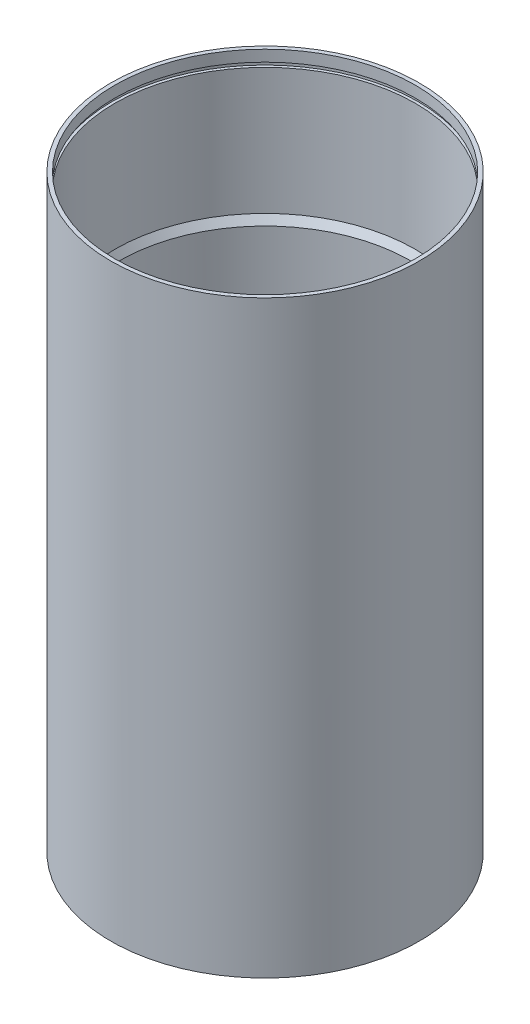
ISO-10303-21;
HEADER;
FILE_DESCRIPTION(('STEP AP214'),'2;1');
FILE_NAME('part.step','',(''),(''),'','','');
FILE_SCHEMA(('AUTOMOTIVE_DESIGN { 1 0 10303 214 1 1 1 1 }'));
ENDSEC;
DATA;
#1=APPLICATION_CONTEXT('core data for automotive mechanical design processes');
#2=APPLICATION_PROTOCOL_DEFINITION('international standard','automotive_design',2000,#1);
#3=PRODUCT_CONTEXT('',#1,'mechanical');
#4=PRODUCT('Part','Part','',(#3));
#5=PRODUCT_RELATED_PRODUCT_CATEGORY('part','',(#4));
#6=PRODUCT_DEFINITION_FORMATION('','',#4);
#7=PRODUCT_DEFINITION_CONTEXT('part definition',#1,'design');
#8=PRODUCT_DEFINITION('design','',#6,#7);
#9=PRODUCT_DEFINITION_SHAPE('','',#8);
#10=(LENGTH_UNIT() NAMED_UNIT(*) SI_UNIT(.MILLI.,.METRE.));
#11=(NAMED_UNIT(*) PLANE_ANGLE_UNIT() SI_UNIT($,.RADIAN.));
#12=(NAMED_UNIT(*) SI_UNIT($,.STERADIAN.) SOLID_ANGLE_UNIT());
#13=UNCERTAINTY_MEASURE_WITH_UNIT(LENGTH_MEASURE(1.E-05),#10,'distance_accuracy_value','');
#14=(GEOMETRIC_REPRESENTATION_CONTEXT(3) GLOBAL_UNCERTAINTY_ASSIGNED_CONTEXT((#13)) GLOBAL_UNIT_ASSIGNED_CONTEXT((#10,
#11,#12)) REPRESENTATION_CONTEXT('',''));
#15=CARTESIAN_POINT('',(0.,0.,0.));
#16=DIRECTION('',(0.,0.,1.));
#17=DIRECTION('',(1.,0.,0.));
#18=AXIS2_PLACEMENT_3D('',#15,#16,#17);
#19=CARTESIAN_POINT('',(0.,80.,0.));
#20=DIRECTION('',(0.,1.,0.));
#21=DIRECTION('',(0.,0.,1.));
#22=AXIS2_PLACEMENT_3D('',#19,#20,#21);
#23=CYLINDRICAL_SURFACE('',#22,26.8);
#24=CARTESIAN_POINT('',(0.,105.,0.));
#25=DIRECTION('',(0.,1.,0.));
#26=DIRECTION('',(0.,0.,1.));
#27=AXIS2_PLACEMENT_3D('',#24,#25,#26);
#28=CIRCLE('',#27,26.8);
#29=CARTESIAN_POINT('',(0.,105.,26.8));
#30=VERTEX_POINT('',#29);
#31=EDGE_CURVE('E264',#30,#30,#28,.T.);
#32=ORIENTED_EDGE('',*,*,#31,.T.);
#33=EDGE_LOOP('',(#32));
#34=FACE_BOUND('',#33,.T.);
#35=CARTESIAN_POINT('',(0.,103.,0.));
#36=DIRECTION('',(0.,-1.,0.));
#37=DIRECTION('',(0.,0.,-1.));
#38=AXIS2_PLACEMENT_3D('',#35,#36,#37);
#39=CIRCLE('',#38,26.8);
#40=CARTESIAN_POINT('',(0.,103.,-26.8));
#41=VERTEX_POINT('',#40);
#42=EDGE_CURVE('E296',#41,#41,#39,.T.);
#43=ORIENTED_EDGE('',*,*,#42,.T.);
#44=EDGE_LOOP('',(#43));
#45=FACE_BOUND('',#44,.T.);
#46=ADVANCED_FACE('F35',(#34,#45),#23,.F.);
#47=CARTESIAN_POINT('',(0.,79.6535898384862,0.));
#48=DIRECTION('',(0.,1.,0.));
#49=DIRECTION('',(0.,0.,1.));
#50=AXIS2_PLACEMENT_3D('',#47,#48,#49);
#51=CIRCLE('',#50,26.8);
#52=CARTESIAN_POINT('',(0.,79.6535898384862,26.8));
#53=VERTEX_POINT('',#52);
#54=EDGE_CURVE('E11',#53,#53,#51,.F.);
#55=ORIENTED_EDGE('',*,*,#54,.T.);
#56=EDGE_LOOP('',(#55));
#57=FACE_BOUND('',#56,.T.);
#58=CARTESIAN_POINT('',(0.,102.2,0.));
#59=DIRECTION('',(0.,1.,0.));
#60=DIRECTION('',(0.,0.,1.));
#61=AXIS2_PLACEMENT_3D('',#58,#59,#60);
#62=CIRCLE('',#61,26.8);
#63=CARTESIAN_POINT('',(0.,102.2,26.8));
#64=VERTEX_POINT('',#63);
#65=EDGE_CURVE('E39',#64,#64,#62,.F.);
#66=ORIENTED_EDGE('',*,*,#65,.F.);
#67=EDGE_LOOP('',(#66));
#68=FACE_BOUND('',#67,.T.);
#69=ADVANCED_FACE('F233',(#57,#68),#23,.F.);
#70=CARTESIAN_POINT('',(0.,105.,0.));
#71=DIRECTION('',(0.,-1.,0.));
#72=DIRECTION('',(0.,0.,-1.));
#73=AXIS2_PLACEMENT_3D('',#70,#71,#72);
#74=CYLINDRICAL_SURFACE('',#73,26.);
#75=CARTESIAN_POINT('',(0.,78.2679491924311,0.));
#76=DIRECTION('',(0.,1.,0.));
#77=DIRECTION('',(0.,0.,1.));
#78=AXIS2_PLACEMENT_3D('',#75,#76,#77);
#79=CIRCLE('',#78,26.);
#80=CARTESIAN_POINT('',(0.,78.2679491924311,26.));
#81=VERTEX_POINT('',#80);
#82=EDGE_CURVE('E44',#81,#81,#79,.T.);
#83=ORIENTED_EDGE('',*,*,#82,.T.);
#84=EDGE_LOOP('',(#83));
#85=FACE_BOUND('',#84,.T.);
#86=CARTESIAN_POINT('',(0.,0.,0.));
#87=DIRECTION('',(0.,1.,0.));
#88=DIRECTION('',(0.,0.,1.));
#89=AXIS2_PLACEMENT_3D('',#86,#87,#88);
#90=CIRCLE('',#89,26.);
#91=CARTESIAN_POINT('',(-8.5,0.,-24.5713247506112));
#92=VERTEX_POINT('',#91);
#93=CARTESIAN_POINT('',(8.5,0.,-24.5713247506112));
#94=VERTEX_POINT('',#93);
#95=EDGE_CURVE('E259',#92,#94,#90,.T.);
#96=ORIENTED_EDGE('',*,*,#95,.F.);
#97=CARTESIAN_POINT('',(-8.5,0.,-24.5713247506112));
#98=CARTESIAN_POINT('',(-8.44182870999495,-3.91145126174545E-05,-24.5914570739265));
#99=CARTESIAN_POINT('',(-8.38356460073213,0.00507484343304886,-24.6113723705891));
#100=CARTESIAN_POINT('',(-8.26844314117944,0.0254324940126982,-24.6502824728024));
#101=CARTESIAN_POINT('',(-8.21158749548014,0.0406878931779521,-24.6692761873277));
#102=CARTESIAN_POINT('',(-8.10094424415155,0.0811780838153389,-24.7058319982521));
#103=CARTESIAN_POINT('',(-8.04716080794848,0.106426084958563,-24.7233921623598));
#104=CARTESIAN_POINT('',(-7.94451263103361,0.166357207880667,-24.7565672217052));
#105=CARTESIAN_POINT('',(-7.89564399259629,0.20103277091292,-24.772183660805));
#106=CARTESIAN_POINT('',(-7.8059967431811,0.277695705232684,-24.8005757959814));
#107=CARTESIAN_POINT('',(-7.76500488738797,0.319405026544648,-24.8134280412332));
#108=CARTESIAN_POINT('',(-7.69063870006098,0.409782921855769,-24.8365778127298));
#109=CARTESIAN_POINT('',(-7.65726506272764,0.458452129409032,-24.8468751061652));
#110=CARTESIAN_POINT('',(-7.60082495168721,0.558818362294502,-24.8641970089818));
#111=CARTESIAN_POINT('',(-7.57734071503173,0.610258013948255,-24.8713549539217));
#112=CARTESIAN_POINT('',(-7.53933933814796,0.716610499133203,-24.8829009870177));
#113=CARTESIAN_POINT('',(-7.52481093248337,0.77151887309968,-24.8872925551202));
#114=CARTESIAN_POINT('',(-7.51002940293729,0.855780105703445,-24.8917553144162));
#115=CARTESIAN_POINT('',(-7.50626972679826,0.884505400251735,-24.892889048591));
#116=CARTESIAN_POINT('',(-7.5012566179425,0.942148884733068,-24.8944000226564));
#117=CARTESIAN_POINT('',(-7.49999932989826,0.971066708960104,-24.8947784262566));
#118=CARTESIAN_POINT('',(-7.5,1.,-24.8947785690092));
#119=B_SPLINE_CURVE_WITH_KNOTS('',3,(#97,#98,#99,#100,#101,#102,#103,#104,#105,#106,#107,#108,
#109,#110,#111,#112,#113,#114,#115,#116,#117,#118),.UNSPECIFIED.,.F.,.F.,(4,2,2,2,2,2,2,2,2,2,
4),(0.,0.18448524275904,0.369183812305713,0.554127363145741,0.738923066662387,0.917639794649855,
1.09637280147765,1.2665288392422,1.43647040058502,1.52334396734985,1.61008358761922),.UNSPECIFIED.);
#120=CARTESIAN_POINT('',(-7.50000000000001,1.,-24.8947785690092));
#121=VERTEX_POINT('',#120);
#122=EDGE_CURVE('E163',#92,#121,#119,.T.);
#123=ORIENTED_EDGE('',*,*,#122,.T.);
#124=DIRECTION('',(0.,-1.,0.));
#125=VECTOR('',#124,1.);
#126=CARTESIAN_POINT('',(-7.50000000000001,105.,-24.8947785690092));
#127=LINE('',#126,#125);
#128=CARTESIAN_POINT('',(-7.50000000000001,13.5,-24.8947785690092));
#129=VERTEX_POINT('',#128);
#130=EDGE_CURVE('E128',#129,#121,#127,.T.);
#131=ORIENTED_EDGE('',*,*,#130,.F.);
#132=CARTESIAN_POINT('',(-7.5,13.5,-24.8947785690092));
#133=CARTESIAN_POINT('',(-7.50000043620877,13.5273039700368,-24.8947781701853));
#134=CARTESIAN_POINT('',(-7.49888099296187,13.5545945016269,-24.8951157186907));
#135=CARTESIAN_POINT('',(-7.49441922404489,13.6089727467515,-24.8964593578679));
#136=CARTESIAN_POINT('',(-7.4910772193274,13.6360604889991,-24.8974653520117));
#137=CARTESIAN_POINT('',(-7.47776791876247,13.7166117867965,-24.9014673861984));
#138=CARTESIAN_POINT('',(-7.46451710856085,13.7695234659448,-24.9054475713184));
#139=CARTESIAN_POINT('',(-7.42971758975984,13.8722513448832,-24.9158508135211));
#140=CARTESIAN_POINT('',(-7.4081687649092,13.9220675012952,-24.9222739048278));
#141=CARTESIAN_POINT('',(-7.35748435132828,14.0173307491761,-24.9372837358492));
#142=CARTESIAN_POINT('',(-7.32834728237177,14.0627769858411,-24.945870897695));
#143=CARTESIAN_POINT('',(-7.26274946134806,14.1490036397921,-24.9650487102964));
#144=CARTESIAN_POINT('',(-7.22615652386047,14.189675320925,-24.9756752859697));
#145=CARTESIAN_POINT('',(-7.14709284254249,14.2643488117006,-24.998415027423));
#146=CARTESIAN_POINT('',(-7.10462047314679,14.298348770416,-25.010528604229));
#147=CARTESIAN_POINT('',(-7.01319243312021,14.3601140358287,-25.0363230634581));
#148=CARTESIAN_POINT('',(-6.96404710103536,14.3875804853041,-25.0500469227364));
#149=CARTESIAN_POINT('',(-6.86202344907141,14.4338495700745,-25.0781863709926));
#150=CARTESIAN_POINT('',(-6.80914575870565,14.4526536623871,-25.0926018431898));
#151=CARTESIAN_POINT('',(-6.71351197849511,14.4778884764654,-25.1183321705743));
#152=CARTESIAN_POINT('',(-6.67122045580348,14.4861691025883,-25.12959875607));
#153=CARTESIAN_POINT('',(-6.5859671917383,14.4972255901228,-25.1520775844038));
#154=CARTESIAN_POINT('',(-6.5430063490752,14.5000082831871,-25.1632898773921));
#155=CARTESIAN_POINT('',(-6.5,14.5,-25.1743917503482));
#156=B_SPLINE_CURVE_WITH_KNOTS('',3,(#132,#133,#134,#135,#136,#137,#138,#139,#140,#141,#142,
#143,#144,#145,#146,#147,#148,#149,#150,#151,#152,#153,#154,#155),.UNSPECIFIED.,.F.,.F.,(4,2,2,
2,2,2,2,2,2,2,2,4),(0.,0.0818603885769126,0.163708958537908,0.326932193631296,0.490157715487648,
0.653415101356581,0.819867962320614,0.986366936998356,1.1594340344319,1.33247201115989,
1.4657685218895,1.5988992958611),.UNSPECIFIED.);
#157=CARTESIAN_POINT('',(-6.5,14.5,-25.1743917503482));
#158=VERTEX_POINT('',#157);
#159=EDGE_CURVE('E206',#129,#158,#156,.T.);
#160=ORIENTED_EDGE('',*,*,#159,.T.);
#161=CARTESIAN_POINT('',(0.,14.5,0.));
#162=DIRECTION('',(0.,1.,0.));
#163=DIRECTION('',(0.,0.,1.));
#164=AXIS2_PLACEMENT_3D('',#161,#162,#163);
#165=CIRCLE('',#164,26.);
#166=CARTESIAN_POINT('',(6.5,14.5,-25.1743917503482));
#167=VERTEX_POINT('',#166);
#168=EDGE_CURVE('E126',#167,#158,#165,.T.);
#169=ORIENTED_EDGE('',*,*,#168,.F.);
#170=CARTESIAN_POINT('',(6.5,14.5,-25.1743917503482));
#171=CARTESIAN_POINT('',(6.55798855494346,14.5000388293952,-25.1594273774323));
#172=CARTESIAN_POINT('',(6.61590978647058,14.4949584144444,-25.1442504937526));
#173=CARTESIAN_POINT('',(6.73002523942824,14.4748966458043,-25.1139430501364));
#174=CARTESIAN_POINT('',(6.78621947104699,14.4599153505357,-25.0988124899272));
#175=CARTESIAN_POINT('',(6.89532098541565,14.4203778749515,-25.0690602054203));
#176=CARTESIAN_POINT('',(6.94822633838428,14.3958161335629,-25.0544387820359));
#177=CARTESIAN_POINT('',(7.04916086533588,14.3377405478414,-25.0262276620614));
#178=CARTESIAN_POINT('',(7.09719164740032,14.3042296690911,-25.0126376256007));
#179=CARTESIAN_POINT('',(7.18640708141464,14.2295156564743,-24.9871504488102));
#180=CARTESIAN_POINT('',(7.22766256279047,14.1884031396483,-24.9752360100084));
#181=CARTESIAN_POINT('',(7.30263085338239,14.0993088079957,-24.9534188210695));
#182=CARTESIAN_POINT('',(7.33634314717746,14.0513265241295,-24.9435162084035));
#183=CARTESIAN_POINT('',(7.39399061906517,13.9516435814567,-24.9264874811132));
#184=CARTESIAN_POINT('',(7.41822497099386,13.9001301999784,-24.9192768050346));
#185=CARTESIAN_POINT('',(7.45764413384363,13.7934944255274,-24.9075083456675));
#186=CARTESIAN_POINT('',(7.47283985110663,13.7383764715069,-24.9029473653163));
#187=CARTESIAN_POINT('',(7.48880964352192,13.6522935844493,-24.8981477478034));
#188=CARTESIAN_POINT('',(7.49300368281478,13.6219799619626,-24.8968855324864));
#189=CARTESIAN_POINT('',(7.49859763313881,13.5611161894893,-24.8952010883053));
#190=CARTESIAN_POINT('',(7.50000148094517,13.5305664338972,-24.8947776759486));
#191=CARTESIAN_POINT('',(7.5,13.5,-24.8947785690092));
#192=B_SPLINE_CURVE_WITH_KNOTS('',3,(#170,#171,#172,#173,#174,#175,#176,#177,#178,#179,#180,
#181,#182,#183,#184,#185,#186,#187,#188,#189,#190,#191),.UNSPECIFIED.,.F.,.F.,(4,2,2,2,2,2,2,2,
2,2,4),(0.,0.179434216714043,0.358867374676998,0.538404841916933,0.717882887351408,
0.895345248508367,1.07281973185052,1.24412390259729,1.41522095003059,1.50698200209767,
1.59861349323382),.UNSPECIFIED.);
#193=CARTESIAN_POINT('',(7.5,13.5,-24.8947785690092));
#194=VERTEX_POINT('',#193);
#195=EDGE_CURVE('E125',#167,#194,#192,.T.);
#196=ORIENTED_EDGE('',*,*,#195,.T.);
#197=DIRECTION('',(0.,-1.,0.));
#198=VECTOR('',#197,1.);
#199=CARTESIAN_POINT('',(7.5,105.,-24.8947785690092));
#200=LINE('',#199,#198);
#201=CARTESIAN_POINT('',(7.5,1.,-24.8947785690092));
#202=VERTEX_POINT('',#201);
#203=EDGE_CURVE('E119',#202,#194,#200,.F.);
#204=ORIENTED_EDGE('',*,*,#203,.F.);
#205=CARTESIAN_POINT('',(7.5,1.,-24.8947785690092));
#206=CARTESIAN_POINT('',(7.49999958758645,0.972765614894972,-24.8947784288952));
#207=CARTESIAN_POINT('',(7.50111331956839,0.9455445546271,-24.8944431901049));
#208=CARTESIAN_POINT('',(7.5055524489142,0.891303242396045,-24.8931052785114));
#209=CARTESIAN_POINT('',(7.50887757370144,0.864282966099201,-24.8921026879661));
#210=CARTESIAN_POINT('',(7.52212148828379,0.783920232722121,-24.8881051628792));
#211=CARTESIAN_POINT('',(7.53530902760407,0.731126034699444,-24.8841204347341));
#212=CARTESIAN_POINT('',(7.56994223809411,0.628618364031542,-24.8736064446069));
#213=CARTESIAN_POINT('',(7.59138885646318,0.57890524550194,-24.8670768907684));
#214=CARTESIAN_POINT('',(7.64181071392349,0.483856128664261,-24.8516281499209));
#215=CARTESIAN_POINT('',(7.6707868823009,0.438520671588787,-24.8427086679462));
#216=CARTESIAN_POINT('',(7.73586050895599,0.352666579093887,-24.8225227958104));
#217=CARTESIAN_POINT('',(7.77206740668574,0.31223958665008,-24.8112201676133));
#218=CARTESIAN_POINT('',(7.85015893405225,0.238022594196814,-24.7866229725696));
#219=CARTESIAN_POINT('',(7.89204472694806,0.204233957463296,-24.7733279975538));
#220=CARTESIAN_POINT('',(7.98206895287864,0.142773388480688,-24.7444720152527));
#221=CARTESIAN_POINT('',(8.0303921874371,0.115405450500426,-24.7288409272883));
#222=CARTESIAN_POINT('',(8.13048309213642,0.0691415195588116,-24.6961133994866));
#223=CARTESIAN_POINT('',(8.18225141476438,0.0502471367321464,-24.6790166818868));
#224=CARTESIAN_POINT('',(8.27834720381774,0.0238395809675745,-24.6469277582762));
#225=CARTESIAN_POINT('',(8.32234602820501,0.0148937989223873,-24.6321073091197));
#226=CARTESIAN_POINT('',(8.41091016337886,0.00297408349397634,-24.6020082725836));
#227=CARTESIAN_POINT('',(8.45547442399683,-9.6429937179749E-06,-24.5867304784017));
#228=CARTESIAN_POINT('',(8.5,0.,-24.5713247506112));
#229=B_SPLINE_CURVE_WITH_KNOTS('',3,(#205,#206,#207,#208,#209,#210,#211,#212,#213,#214,#215,
#216,#217,#218,#219,#220,#221,#222,#223,#224,#225,#226,#227,#228),.UNSPECIFIED.,.F.,.F.,(4,2,2,
2,2,2,2,2,2,2,2,4),(0.,0.0816520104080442,0.163293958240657,0.326134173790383,0.488993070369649,
0.65187207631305,0.817434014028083,0.983029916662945,1.15534826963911,1.32769935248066,
1.46917092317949,1.61040992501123),.UNSPECIFIED.);
#230=EDGE_CURVE('E104',#202,#94,#229,.T.);
#231=ORIENTED_EDGE('',*,*,#230,.T.);
#232=EDGE_LOOP('',(#96,#123,#131,#160,#169,#196,#204,#231));
#233=FACE_BOUND('',#232,.T.);
#234=ADVANCED_FACE('F123',(#85,#233),#74,.F.);
#235=CARTESIAN_POINT('',(0.,105.,0.));
#236=DIRECTION('',(0.,1.,0.));
#237=DIRECTION('',(0.,0.,1.));
#238=AXIS2_PLACEMENT_3D('',#235,#236,#237);
#239=PLANE('',#238);
#240=ORIENTED_EDGE('',*,*,#31,.F.);
#241=EDGE_LOOP('',(#240));
#242=FACE_BOUND('',#241,.T.);
#243=CARTESIAN_POINT('',(0.,105.,0.));
#244=DIRECTION('',(0.,1.,0.));
#245=DIRECTION('',(0.,0.,1.));
#246=AXIS2_PLACEMENT_3D('',#243,#244,#245);
#247=CIRCLE('',#246,27.5);
#248=CARTESIAN_POINT('',(0.,105.,27.5));
#249=VERTEX_POINT('',#248);
#250=EDGE_CURVE('E270',#249,#249,#247,.T.);
#251=ORIENTED_EDGE('',*,*,#250,.T.);
#252=EDGE_LOOP('',(#251));
#253=FACE_BOUND('',#252,.T.);
#254=ADVANCED_FACE('F284',(#242,#253),#239,.T.);
#255=CARTESIAN_POINT('',(0.,0.,0.));
#256=DIRECTION('',(0.,1.,0.));
#257=DIRECTION('',(0.,0.,1.));
#258=AXIS2_PLACEMENT_3D('',#255,#256,#257);
#259=PLANE('',#258);
#260=CARTESIAN_POINT('',(0.,0.,0.));
#261=DIRECTION('',(0.,1.,0.));
#262=DIRECTION('',(0.,0.,1.));
#263=AXIS2_PLACEMENT_3D('',#260,#261,#262);
#264=CIRCLE('',#263,27.5);
#265=CARTESIAN_POINT('',(-8.5,0.,-26.153393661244));
#266=VERTEX_POINT('',#265);
#267=CARTESIAN_POINT('',(8.5,0.,-26.153393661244));
#268=VERTEX_POINT('',#267);
#269=EDGE_CURVE('E269',#266,#268,#264,.T.);
#270=ORIENTED_EDGE('',*,*,#269,.F.);
#271=DIRECTION('',(0.,0.,1.));
#272=VECTOR('',#271,1.);
#273=CARTESIAN_POINT('',(-8.5,0.,0.));
#274=LINE('',#273,#272);
#275=EDGE_CURVE('E160',#266,#92,#274,.T.);
#276=ORIENTED_EDGE('',*,*,#275,.T.);
#277=ORIENTED_EDGE('',*,*,#95,.T.);
#278=DIRECTION('',(0.,0.,1.));
#279=VECTOR('',#278,1.);
#280=CARTESIAN_POINT('',(8.5,0.,0.));
#281=LINE('',#280,#279);
#282=EDGE_CURVE('E110',#94,#268,#281,.F.);
#283=ORIENTED_EDGE('',*,*,#282,.T.);
#284=EDGE_LOOP('',(#270,#276,#277,#283));
#285=FACE_BOUND('',#284,.T.);
#286=ADVANCED_FACE('F254',(#285),#259,.F.);
#287=CARTESIAN_POINT('',(0.,105.,0.));
#288=DIRECTION('',(0.,-1.,0.));
#289=DIRECTION('',(0.,0.,-1.));
#290=AXIS2_PLACEMENT_3D('',#287,#288,#289);
#291=CYLINDRICAL_SURFACE('',#290,27.5);
#292=ORIENTED_EDGE('',*,*,#250,.F.);
#293=EDGE_LOOP('',(#292));
#294=FACE_BOUND('',#293,.T.);
#295=DIRECTION('',(0.,-1.,0.));
#296=VECTOR('',#295,1.);
#297=CARTESIAN_POINT('',(-7.50000000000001,105.,-26.4575131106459));
#298=LINE('',#297,#296);
#299=CARTESIAN_POINT('',(-7.50000000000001,13.5,-26.4575131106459));
#300=VERTEX_POINT('',#299);
#301=CARTESIAN_POINT('',(-7.50000000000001,1.,-26.4575131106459));
#302=VERTEX_POINT('',#301);
#303=EDGE_CURVE('E262',#300,#302,#298,.T.);
#304=ORIENTED_EDGE('',*,*,#303,.T.);
#305=CARTESIAN_POINT('',(-7.5,1.,-26.4575131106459));
#306=CARTESIAN_POINT('',(-7.49999964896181,0.972668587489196,-26.4575129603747));
#307=CARTESIAN_POINT('',(-7.5011212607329,0.945350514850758,-26.4571952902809));
#308=CARTESIAN_POINT('',(-7.50559223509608,0.890915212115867,-26.4559273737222));
#309=CARTESIAN_POINT('',(-7.50894134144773,0.863797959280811,-26.4549772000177));
#310=CARTESIAN_POINT('',(-7.52228282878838,0.783139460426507,-26.4511880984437));
#311=CARTESIAN_POINT('',(-7.53556957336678,0.730147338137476,-26.4474105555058));
#312=CARTESIAN_POINT('',(-7.5704761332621,0.627250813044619,-26.4374396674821));
#313=CARTESIAN_POINT('',(-7.5920972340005,0.577346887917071,-26.4312459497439));
#314=CARTESIAN_POINT('',(-7.64294965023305,0.481940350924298,-26.4165860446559));
#315=CARTESIAN_POINT('',(-7.67218165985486,0.436438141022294,-26.4081196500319));
#316=CARTESIAN_POINT('',(-7.73780200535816,0.350364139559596,-26.3889674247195));
#317=CARTESIAN_POINT('',(-7.77428964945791,0.309875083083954,-26.3782506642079));
#318=CARTESIAN_POINT('',(-7.85301121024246,0.235581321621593,-26.3549217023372));
#319=CARTESIAN_POINT('',(-7.89524631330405,0.201778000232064,-26.3423091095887));
#320=CARTESIAN_POINT('',(-7.98585201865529,0.140493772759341,-26.3149859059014));
#321=CARTESIAN_POINT('',(-8.03438956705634,0.113286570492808,-26.30021580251));
#322=CARTESIAN_POINT('',(-8.1349292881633,0.0673814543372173,-26.2692917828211));
#323=CARTESIAN_POINT('',(-8.18693183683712,0.0486844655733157,-26.2531377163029));
#324=CARTESIAN_POINT('',(-8.2824758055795,0.022951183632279,-26.2231305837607));
#325=CARTESIAN_POINT('',(-8.32565750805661,0.0143403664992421,-26.2094539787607));
#326=CARTESIAN_POINT('',(-8.41257014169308,0.0028648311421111,-26.1816877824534));
#327=CARTESIAN_POINT('',(-8.45630007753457,-9.10873909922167E-06,-26.1675988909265));
#328=CARTESIAN_POINT('',(-8.5,0.,-26.153393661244));
#329=B_SPLINE_CURVE_WITH_KNOTS('',3,(#305,#306,#307,#308,#309,#310,#311,#312,#313,#314,#315,
#316,#317,#318,#319,#320,#321,#322,#323,#324,#325,#326,#327,#328),.UNSPECIFIED.,.F.,.F.,(4,2,2,
2,2,2,2,2,2,2,2,4),(0.,0.0819430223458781,0.163876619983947,0.327317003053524,0.490782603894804,
0.654263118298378,0.820157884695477,0.986086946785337,1.15803276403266,1.32999726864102,
1.46796512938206,1.60571103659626),.UNSPECIFIED.);
#330=EDGE_CURVE('E174',#302,#266,#329,.T.);
#331=ORIENTED_EDGE('',*,*,#330,.T.);
#332=ORIENTED_EDGE('',*,*,#269,.T.);
#333=CARTESIAN_POINT('',(8.5,0.,-26.153393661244));
#334=CARTESIAN_POINT('',(8.44205385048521,-4.01872291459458E-05,-26.172234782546));
#335=CARTESIAN_POINT('',(8.3840279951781,0.00503538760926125,-26.1908724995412));
#336=CARTESIAN_POINT('',(8.26941063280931,0.0252196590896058,-26.2272825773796));
#337=CARTESIAN_POINT('',(8.21282049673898,0.040337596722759,-26.2450541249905));
#338=CARTESIAN_POINT('',(8.10271370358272,0.0804320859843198,-26.2792578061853));
#339=CARTESIAN_POINT('',(8.04920090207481,0.105420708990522,-26.295688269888));
#340=CARTESIAN_POINT('',(7.94705528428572,0.164695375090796,-26.3267383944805));
#341=CARTESIAN_POINT('',(7.89841897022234,0.198974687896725,-26.3413593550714));
#342=CARTESIAN_POINT('',(7.80896374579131,0.274872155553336,-26.3680148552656));
#343=CARTESIAN_POINT('',(7.76795970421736,0.316249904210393,-26.3801118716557));
#344=CARTESIAN_POINT('',(7.69350669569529,0.405894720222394,-26.4019215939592));
#345=CARTESIAN_POINT('',(7.66005853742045,0.454162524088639,-26.4116340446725));
#346=CARTESIAN_POINT('',(7.60321726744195,0.553973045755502,-26.4280519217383));
#347=CARTESIAN_POINT('',(7.57945658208,0.605288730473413,-26.4348678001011));
#348=CARTESIAN_POINT('',(7.54088769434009,0.711414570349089,-26.4458960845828));
#349=CARTESIAN_POINT('',(7.52606894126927,0.766220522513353,-26.4501115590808));
#350=CARTESIAN_POINT('',(7.51066983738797,0.851270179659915,-26.4544866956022));
#351=CARTESIAN_POINT('',(7.50667023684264,0.880885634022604,-26.4556215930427));
#352=CARTESIAN_POINT('',(7.50133683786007,0.940329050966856,-26.457134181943));
#353=CARTESIAN_POINT('',(7.49999897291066,0.970156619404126,-26.4575130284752));
#354=CARTESIAN_POINT('',(7.5,1.,-26.4575131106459));
#355=B_SPLINE_CURVE_WITH_KNOTS('',3,(#333,#334,#335,#336,#337,#338,#339,#340,#341,#342,#343,
#344,#345,#346,#347,#348,#349,#350,#351,#352,#353,#354),.UNSPECIFIED.,.F.,.F.,(4,2,2,2,2,2,2,2,
2,2,4),(0.,0.182607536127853,0.365383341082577,0.548383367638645,0.731251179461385,
0.908840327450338,1.08644847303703,1.25649226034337,1.42633501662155,1.51593866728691,
1.60540531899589),.UNSPECIFIED.);
#356=CARTESIAN_POINT('',(7.5,1.,-26.4575131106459));
#357=VERTEX_POINT('',#356);
#358=EDGE_CURVE('E154',#268,#357,#355,.T.);
#359=ORIENTED_EDGE('',*,*,#358,.T.);
#360=DIRECTION('',(0.,-1.,0.));
#361=VECTOR('',#360,1.);
#362=CARTESIAN_POINT('',(7.5,105.,-26.4575131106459));
#363=LINE('',#362,#361);
#364=CARTESIAN_POINT('',(7.5,13.5,-26.4575131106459));
#365=VERTEX_POINT('',#364);
#366=EDGE_CURVE('E121',#357,#365,#363,.F.);
#367=ORIENTED_EDGE('',*,*,#366,.T.);
#368=CARTESIAN_POINT('',(7.5,13.5,-26.4575131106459));
#369=CARTESIAN_POINT('',(7.50000037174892,13.5273934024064,-26.4575127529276));
#370=CARTESIAN_POINT('',(7.49887365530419,13.5547733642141,-26.4578324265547));
#371=CARTESIAN_POINT('',(7.49438244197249,13.609330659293,-26.4591050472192));
#372=CARTESIAN_POINT('',(7.49101824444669,13.6365080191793,-26.4600579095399));
#373=CARTESIAN_POINT('',(7.47761829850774,13.717334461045,-26.4638492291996));
#374=CARTESIAN_POINT('',(7.46427498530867,13.7704312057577,-26.4676205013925));
#375=CARTESIAN_POINT('',(7.42921963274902,13.8735238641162,-26.4774814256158));
#376=CARTESIAN_POINT('',(7.40750705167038,13.9235195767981,-26.4835712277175));
#377=CARTESIAN_POINT('',(7.35641933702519,14.0191169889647,-26.4978073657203));
#378=CARTESIAN_POINT('',(7.32704300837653,14.0647180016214,-26.5059540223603));
#379=CARTESIAN_POINT('',(7.26095231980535,14.1511239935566,-26.5241354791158));
#380=CARTESIAN_POINT('',(7.22411840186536,14.191830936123,-26.5342008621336));
#381=CARTESIAN_POINT('',(7.14452395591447,14.2665305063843,-26.5557427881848));
#382=CARTESIAN_POINT('',(7.10176182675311,14.300521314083,-26.5672197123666));
#383=CARTESIAN_POINT('',(7.00990007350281,14.3620704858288,-26.5916083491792));
#384=CARTESIAN_POINT('',(6.96063047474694,14.3893606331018,-26.6045563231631));
#385=CARTESIAN_POINT('',(6.85836961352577,14.435259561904,-26.6311012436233));
#386=CARTESIAN_POINT('',(6.80537914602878,14.4538701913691,-26.6446980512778));
#387=CARTESIAN_POINT('',(6.71024825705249,14.4785663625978,-26.6687899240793));
#388=CARTESIAN_POINT('',(6.66858855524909,14.4865937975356,-26.6792385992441));
#389=CARTESIAN_POINT('',(6.58463249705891,14.4973112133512,-26.7000844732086));
#390=CARTESIAN_POINT('',(6.54233700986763,14.5000079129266,-26.7104817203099));
#391=CARTESIAN_POINT('',(6.5,14.5,-26.7207784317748));
#392=B_SPLINE_CURVE_WITH_KNOTS('',3,(#368,#369,#370,#371,#372,#373,#374,#375,#376,#377,#378,
#379,#380,#381,#382,#383,#384,#385,#386,#387,#388,#389,#390,#391),.UNSPECIFIED.,.F.,.F.,(4,2,2,
2,2,2,2,2,2,2,2,4),(0.,0.0821286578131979,0.164246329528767,0.32802774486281,0.49181976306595,
0.655637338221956,0.822325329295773,0.989058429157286,1.16165446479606,1.33421373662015,
1.4649775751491,1.59557649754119),.UNSPECIFIED.);
#393=CARTESIAN_POINT('',(6.5,14.5,-26.7207784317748));
#394=VERTEX_POINT('',#393);
#395=EDGE_CURVE('E58',#365,#394,#392,.T.);
#396=ORIENTED_EDGE('',*,*,#395,.T.);
#397=CARTESIAN_POINT('',(0.,14.5,0.));
#398=DIRECTION('',(0.,1.,0.));
#399=DIRECTION('',(0.,0.,1.));
#400=AXIS2_PLACEMENT_3D('',#397,#398,#399);
#401=CIRCLE('',#400,27.5);
#402=CARTESIAN_POINT('',(-6.5,14.5,-26.7207784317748));
#403=VERTEX_POINT('',#402);
#404=EDGE_CURVE('E256',#394,#403,#401,.T.);
#405=ORIENTED_EDGE('',*,*,#404,.T.);
#406=CARTESIAN_POINT('',(-6.5,14.5,-26.7207784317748));
#407=CARTESIAN_POINT('',(-6.5577925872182,14.500039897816,-26.7067276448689));
#408=CARTESIAN_POINT('',(-6.61552417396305,14.4949924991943,-26.6924780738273));
#409=CARTESIAN_POINT('',(-6.72927148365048,14.4750623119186,-26.6640250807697));
#410=CARTESIAN_POINT('',(-6.78528736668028,14.4601804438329,-26.6498216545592));
#411=CARTESIAN_POINT('',(-6.8940518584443,14.4209091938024,-26.6218939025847));
#412=CARTESIAN_POINT('',(-6.94679858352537,14.3965143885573,-26.6081698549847));
#413=CARTESIAN_POINT('',(-7.04744600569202,14.3388465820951,-26.5816893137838));
#414=CARTESIAN_POINT('',(-7.0953482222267,14.3055763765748,-26.568932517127));
#415=CARTESIAN_POINT('',(-7.18441359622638,14.2313719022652,-26.5449865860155));
#416=CARTESIAN_POINT('',(-7.22563890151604,14.1905169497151,-26.533783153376));
#417=CARTESIAN_POINT('',(-7.30059885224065,14.1019993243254,-26.5132565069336));
#418=CARTESIAN_POINT('',(-7.33433285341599,14.0543360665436,-26.5039334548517));
#419=CARTESIAN_POINT('',(-7.39221802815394,13.9551316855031,-26.4878460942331));
#420=CARTESIAN_POINT('',(-7.41663261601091,13.9037554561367,-26.4810117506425));
#421=CARTESIAN_POINT('',(-7.45643775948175,13.7973917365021,-26.4698312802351));
#422=CARTESIAN_POINT('',(-7.4718385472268,13.7424084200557,-26.4654823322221));
#423=CARTESIAN_POINT('',(-7.48828882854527,13.6557775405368,-26.4608307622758));
#424=CARTESIAN_POINT('',(-7.4926779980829,13.6247767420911,-26.4595878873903));
#425=CARTESIAN_POINT('',(-7.49853242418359,13.5625226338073,-26.4579291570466));
#426=CARTESIAN_POINT('',(-7.5000017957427,13.5312697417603,-26.4575121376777));
#427=CARTESIAN_POINT('',(-7.5,13.5,-26.4575131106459));
#428=B_SPLINE_CURVE_WITH_KNOTS('',3,(#406,#407,#408,#409,#410,#411,#412,#413,#414,#415,#416,
#417,#418,#419,#420,#421,#422,#423,#424,#425,#426,#427),.UNSPECIFIED.,.F.,.F.,(4,2,2,2,2,2,2,2,
2,2,4),(0.,0.178198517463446,0.356380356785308,0.534663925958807,0.712891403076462,
0.889350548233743,1.06582486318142,1.23685754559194,1.40769569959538,1.50156706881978,
1.59530604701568),.UNSPECIFIED.);
#429=EDGE_CURVE('E212',#403,#300,#428,.T.);
#430=ORIENTED_EDGE('',*,*,#429,.T.);
#431=EDGE_LOOP('',(#304,#331,#332,#359,#367,#396,#405,#430));
#432=FACE_BOUND('',#431,.T.);
#433=ADVANCED_FACE('F148',(#294,#432),#291,.T.);
#434=CARTESIAN_POINT('',(7.5,14.5,-100.));
#435=DIRECTION('',(0.,1.,0.));
#436=DIRECTION('',(0.,0.,1.));
#437=AXIS2_PLACEMENT_3D('',#434,#435,#436);
#438=PLANE('',#437);
#439=ORIENTED_EDGE('',*,*,#404,.F.);
#440=DIRECTION('',(0.,0.,1.));
#441=VECTOR('',#440,1.);
#442=CARTESIAN_POINT('',(6.5,14.5,-24.8947785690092));
#443=LINE('',#442,#441);
#444=EDGE_CURVE('E181',#394,#167,#443,.T.);
#445=ORIENTED_EDGE('',*,*,#444,.T.);
#446=ORIENTED_EDGE('',*,*,#168,.T.);
#447=DIRECTION('',(0.,0.,1.));
#448=VECTOR('',#447,1.);
#449=CARTESIAN_POINT('',(-6.5,14.5,-26.4575131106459));
#450=LINE('',#449,#448);
#451=EDGE_CURVE('E51',#158,#403,#450,.F.);
#452=ORIENTED_EDGE('',*,*,#451,.T.);
#453=EDGE_LOOP('',(#439,#445,#446,#452));
#454=FACE_BOUND('',#453,.T.);
#455=ADVANCED_FACE('F247',(#454),#438,.F.);
#456=CARTESIAN_POINT('',(7.5,0.,-100.));
#457=DIRECTION('',(1.,0.,0.));
#458=DIRECTION('',(0.,0.,-1.));
#459=AXIS2_PLACEMENT_3D('',#456,#457,#458);
#460=PLANE('',#459);
#461=ORIENTED_EDGE('',*,*,#203,.T.);
#462=DIRECTION('',(0.,0.,1.));
#463=VECTOR('',#462,1.);
#464=CARTESIAN_POINT('',(7.5,13.5,-26.4575131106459));
#465=LINE('',#464,#463);
#466=EDGE_CURVE('E184',#194,#365,#465,.F.);
#467=ORIENTED_EDGE('',*,*,#466,.T.);
#468=ORIENTED_EDGE('',*,*,#366,.F.);
#469=DIRECTION('',(0.,0.,1.));
#470=VECTOR('',#469,1.);
#471=CARTESIAN_POINT('',(7.5,1.,-100.));
#472=LINE('',#471,#470);
#473=EDGE_CURVE('E108',#357,#202,#472,.T.);
#474=ORIENTED_EDGE('',*,*,#473,.T.);
#475=EDGE_LOOP('',(#461,#467,#468,#474));
#476=FACE_BOUND('',#475,.T.);
#477=ADVANCED_FACE('F118',(#476),#460,.F.);
#478=CARTESIAN_POINT('',(-7.5,14.5,-100.));
#479=DIRECTION('',(-1.,0.,0.));
#480=DIRECTION('',(0.,-1.,0.));
#481=AXIS2_PLACEMENT_3D('',#478,#479,#480);
#482=PLANE('',#481);
#483=ORIENTED_EDGE('',*,*,#130,.T.);
#484=DIRECTION('',(0.,0.,1.));
#485=VECTOR('',#484,1.);
#486=CARTESIAN_POINT('',(-7.5,1.,-100.));
#487=LINE('',#486,#485);
#488=EDGE_CURVE('E172',#121,#302,#487,.F.);
#489=ORIENTED_EDGE('',*,*,#488,.T.);
#490=ORIENTED_EDGE('',*,*,#303,.F.);
#491=DIRECTION('',(0.,0.,1.));
#492=VECTOR('',#491,1.);
#493=CARTESIAN_POINT('',(-7.5,13.5,-24.8947785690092));
#494=LINE('',#493,#492);
#495=EDGE_CURVE('E169',#300,#129,#494,.T.);
#496=ORIENTED_EDGE('',*,*,#495,.T.);
#497=EDGE_LOOP('',(#483,#489,#490,#496));
#498=FACE_BOUND('',#497,.T.);
#499=ADVANCED_FACE('F147',(#498),#482,.F.);
#500=CARTESIAN_POINT('',(8.5,1.,-100.));
#501=DIRECTION('',(0.,0.,1.));
#502=DIRECTION('',(1.,0.,0.));
#503=AXIS2_PLACEMENT_3D('',#500,#501,#502);
#504=CYLINDRICAL_SURFACE('',#503,1.);
#505=ORIENTED_EDGE('',*,*,#358,.F.);
#506=ORIENTED_EDGE('',*,*,#282,.F.);
#507=ORIENTED_EDGE('',*,*,#230,.F.);
#508=ORIENTED_EDGE('',*,*,#473,.F.);
#509=EDGE_LOOP('',(#505,#506,#507,#508));
#510=FACE_BOUND('',#509,.T.);
#511=ADVANCED_FACE('F107',(#510),#504,.T.);
#512=CARTESIAN_POINT('',(-8.5,1.,0.));
#513=DIRECTION('',(0.,0.,1.));
#514=DIRECTION('',(1.,0.,0.));
#515=AXIS2_PLACEMENT_3D('',#512,#513,#514);
#516=CYLINDRICAL_SURFACE('',#515,1.);
#517=ORIENTED_EDGE('',*,*,#330,.F.);
#518=ORIENTED_EDGE('',*,*,#488,.F.);
#519=ORIENTED_EDGE('',*,*,#122,.F.);
#520=ORIENTED_EDGE('',*,*,#275,.F.);
#521=EDGE_LOOP('',(#517,#518,#519,#520));
#522=FACE_BOUND('',#521,.T.);
#523=ADVANCED_FACE('F146',(#522),#516,.T.);
#524=CARTESIAN_POINT('',(6.5,13.5,-100.));
#525=DIRECTION('',(0.,0.,-1.));
#526=DIRECTION('',(-1.,0.,0.));
#527=AXIS2_PLACEMENT_3D('',#524,#525,#526);
#528=CYLINDRICAL_SURFACE('',#527,1.);
#529=ORIENTED_EDGE('',*,*,#395,.F.);
#530=ORIENTED_EDGE('',*,*,#466,.F.);
#531=ORIENTED_EDGE('',*,*,#195,.F.);
#532=ORIENTED_EDGE('',*,*,#444,.F.);
#533=EDGE_LOOP('',(#529,#530,#531,#532));
#534=FACE_BOUND('',#533,.T.);
#535=ADVANCED_FACE('F196',(#534),#528,.F.);
#536=CARTESIAN_POINT('',(-6.5,13.5,-100.));
#537=DIRECTION('',(0.,0.,-1.));
#538=DIRECTION('',(-1.,0.,0.));
#539=AXIS2_PLACEMENT_3D('',#536,#537,#538);
#540=CYLINDRICAL_SURFACE('',#539,1.);
#541=ORIENTED_EDGE('',*,*,#429,.F.);
#542=ORIENTED_EDGE('',*,*,#451,.F.);
#543=ORIENTED_EDGE('',*,*,#159,.F.);
#544=ORIENTED_EDGE('',*,*,#495,.F.);
#545=EDGE_LOOP('',(#541,#542,#543,#544));
#546=FACE_BOUND('',#545,.T.);
#547=ADVANCED_FACE('F199',(#546),#540,.F.);
#548=CARTESIAN_POINT('',(0.,78.2679491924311,0.));
#549=DIRECTION('',(0.,1.,0.));
#550=DIRECTION('',(0.,0.,1.));
#551=AXIS2_PLACEMENT_3D('',#548,#549,#550);
#552=CONICAL_SURFACE('',#551,26.,0.523598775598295);
#553=ORIENTED_EDGE('',*,*,#54,.F.);
#554=EDGE_LOOP('',(#553));
#555=FACE_BOUND('',#554,.T.);
#556=ORIENTED_EDGE('',*,*,#82,.F.);
#557=EDGE_LOOP('',(#556));
#558=FACE_BOUND('',#557,.T.);
#559=ADVANCED_FACE('F37',(#555,#558),#552,.F.);
#560=CARTESIAN_POINT('',(0.,102.2,27.3));
#561=DIRECTION('',(0.,1.,0.));
#562=DIRECTION('',(0.,0.,1.));
#563=AXIS2_PLACEMENT_3D('',#560,#561,#562);
#564=PLANE('',#563);
#565=CARTESIAN_POINT('',(0.,102.2,0.));
#566=DIRECTION('',(0.,-1.,0.));
#567=DIRECTION('',(0.,0.,-1.));
#568=AXIS2_PLACEMENT_3D('',#565,#566,#567);
#569=CIRCLE('',#568,27.3);
#570=CARTESIAN_POINT('',(0.,102.2,-27.3));
#571=VERTEX_POINT('',#570);
#572=EDGE_CURVE('E303',#571,#571,#569,.T.);
#573=ORIENTED_EDGE('',*,*,#572,.F.);
#574=EDGE_LOOP('',(#573));
#575=FACE_BOUND('',#574,.T.);
#576=ORIENTED_EDGE('',*,*,#65,.T.);
#577=EDGE_LOOP('',(#576));
#578=FACE_BOUND('',#577,.T.);
#579=ADVANCED_FACE('F223',(#575,#578),#564,.T.);
#580=CARTESIAN_POINT('',(0.,103.,26.8));
#581=DIRECTION('',(0.,-1.,0.));
#582=DIRECTION('',(0.,0.,-1.));
#583=AXIS2_PLACEMENT_3D('',#580,#581,#582);
#584=PLANE('',#583);
#585=CARTESIAN_POINT('',(0.,103.,0.));
#586=DIRECTION('',(0.,-1.,0.));
#587=DIRECTION('',(0.,0.,-1.));
#588=AXIS2_PLACEMENT_3D('',#585,#586,#587);
#589=CIRCLE('',#588,27.3);
#590=CARTESIAN_POINT('',(0.,103.,-27.3));
#591=VERTEX_POINT('',#590);
#592=EDGE_CURVE('E300',#591,#591,#589,.T.);
#593=ORIENTED_EDGE('',*,*,#592,.T.);
#594=EDGE_LOOP('',(#593));
#595=FACE_BOUND('',#594,.T.);
#596=ORIENTED_EDGE('',*,*,#42,.F.);
#597=EDGE_LOOP('',(#596));
#598=FACE_BOUND('',#597,.T.);
#599=ADVANCED_FACE('F228',(#595,#598),#584,.T.);
#600=CARTESIAN_POINT('',(0.,102.2,0.));
#601=DIRECTION('',(0.,-1.,0.));
#602=DIRECTION('',(0.,0.,-1.));
#603=AXIS2_PLACEMENT_3D('',#600,#601,#602);
#604=CYLINDRICAL_SURFACE('',#603,27.3);
#605=ORIENTED_EDGE('',*,*,#572,.T.);
#606=EDGE_LOOP('',(#605));
#607=FACE_BOUND('',#606,.T.);
#608=ORIENTED_EDGE('',*,*,#592,.F.);
#609=EDGE_LOOP('',(#608));
#610=FACE_BOUND('',#609,.T.);
#611=ADVANCED_FACE('F307',(#607,#610),#604,.F.);
#612=CLOSED_SHELL('',(#46,#69,#234,#254,#286,#433,#455,#477,#499,#511,#523,#535,#547,#559,#579,
#599,#611));
#613=MANIFOLD_SOLID_BREP('B2',#612);
#614=ADVANCED_BREP_SHAPE_REPRESENTATION('',(#18,#613),#14);
#615=SHAPE_DEFINITION_REPRESENTATION(#9,#614);
ENDSEC;
END-ISO-10303-21;
